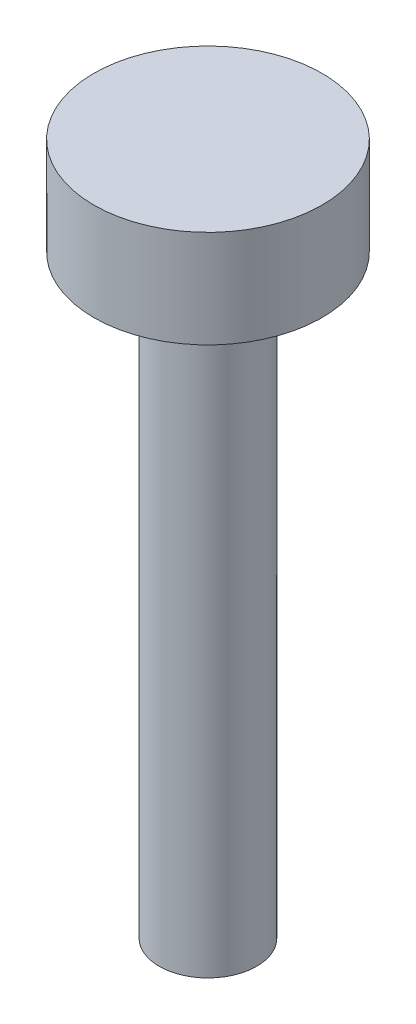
from build123d import *

# Parameters (mm, degrees)
PAN_HEAD_PHILLIPS_SLOT_1_DEPTH = 0.5207
PAN_HEAD_PHILLIPS_SLOT_2_COUNT = 2
PAN_HEAD_PHILLIPS_SLOT_2_ANGLE = 90
SKETCH17_R                     = 4.8768
F_8_MAX_HEAD_SIZE_DEPTH        = 4.1656


with BuildPart() as part:
    # Sketch2 → Body (revolve)
    with BuildSketch(Plane(origin=(0, 0, 0), x_dir=(0, 0, -1), z_dir=(1, 0, 0))):
        Polygon((0, -25.4), (0, 4.1656), (4.8768, 4.1656), (4.8768, 0), (2.0828, 0), (2.0828, -25.4), align=None)
    revolve(axis=Axis((0, -25.4, 0), (0, 1, 0)))

    # Sketch13 → Pan Head _Phillips (revolve, cut)
    with BuildSketch(Plane(origin=(0, 0, 0), x_dir=(0, 0, -1), z_dir=(1, 0, 0)), mode=Mode.PRIVATE) as pan_head_phillips_sk:
        with BuildLine():
            Line((4.0894, 1.1176), (4.0894, 0))
            Line((4.0894, 0), (4.8768, 0))
            Line((4.8768, 0), (4.8768, 4.1656))
            Line((4.8768, 4.1656), (0, 4.1656))
            Line((0, 4.1656), (0, 2.4384))
            Line((0, 2.4384), (2.7686, 2.4384))
            ThreePointArc((2.7686, 2.4384), (3.702546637, 2.051546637), (4.0894, 1.1176))
        make_face()
    revolve(pan_head_phillips_sk.sketch.rotate(Axis((0, 3.691200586, 0), (0, -1, 0)), 180), axis=Axis((0, 3.691200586, 0), (0, -1, 0)), mode=Mode.SUBTRACT)

    # Sketch15 → Pan Head Phillips slot 1 (cut, symmetric)
    with BuildSketch(Plane(origin=(0, 0, 0), x_dir=(0, 0, -1), z_dir=(1, 0, 0))):
        Polygon((-0.912725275, 0.889), (0.912725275, 0.889), (2.7686, 2.4384), (-2.7686, 2.4384), align=None)
    pan_head_phillips_slot_1 = extrude(amount=PAN_HEAD_PHILLIPS_SLOT_1_DEPTH, both=True, mode=Mode.SUBTRACT)

    # Pan Head Phillips slot 2: Pan Head Phillips slot 1 ×2 about axis
    pan_head_phillips_slot_2_axis = Axis((0, 0, 0), (0, 1, 0))
    for i in range(1, PAN_HEAD_PHILLIPS_SLOT_2_COUNT):
        add(pan_head_phillips_slot_1.rotate(pan_head_phillips_slot_2_axis, i * PAN_HEAD_PHILLIPS_SLOT_2_ANGLE / (PAN_HEAD_PHILLIPS_SLOT_2_COUNT - 1)), mode=Mode.SUBTRACT)


with BuildPart() as body_2:
    # Sketch17 → 8 MAX HEAD SIZE (new body)
    with BuildSketch(Plane(origin=(0, 0, 0), x_dir=(1, 0, 0), z_dir=(0, 1, 0))):
        with Locations(Location((0, 0, 0), (0, 0, 270))):
            Circle(SKETCH17_R)
    extrude(amount=F_8_MAX_HEAD_SIZE_DEPTH)


solid = Compound([part.part, body_2.part])
